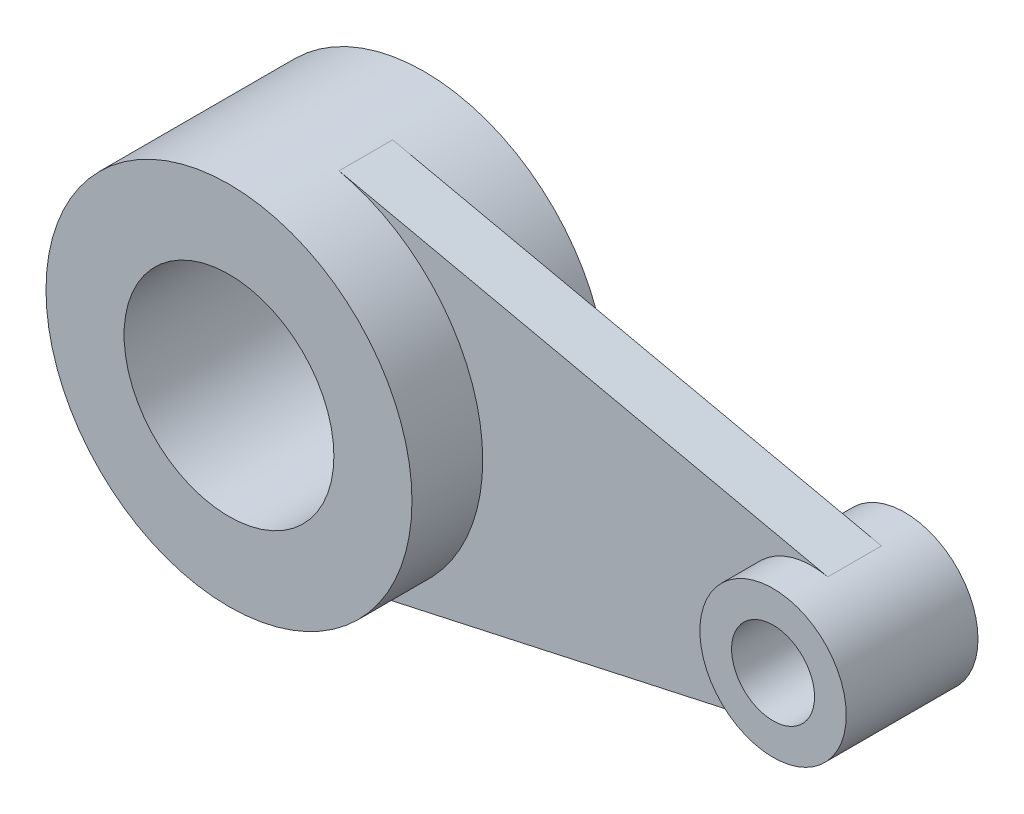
ISO-10303-21;
HEADER;
FILE_DESCRIPTION(('STEP AP214'),'2;1');
FILE_NAME('part.step','',(''),(''),'','','');
FILE_SCHEMA(('AUTOMOTIVE_DESIGN { 1 0 10303 214 1 1 1 1 }'));
ENDSEC;
DATA;
#1=APPLICATION_CONTEXT('core data for automotive mechanical design processes');
#2=APPLICATION_PROTOCOL_DEFINITION('international standard','automotive_design',2000,#1);
#3=PRODUCT_CONTEXT('',#1,'mechanical');
#4=PRODUCT('Part','Part','',(#3));
#5=PRODUCT_RELATED_PRODUCT_CATEGORY('part','',(#4));
#6=PRODUCT_DEFINITION_FORMATION('','',#4);
#7=PRODUCT_DEFINITION_CONTEXT('part definition',#1,'design');
#8=PRODUCT_DEFINITION('design','',#6,#7);
#9=PRODUCT_DEFINITION_SHAPE('','',#8);
#10=(LENGTH_UNIT() NAMED_UNIT(*) SI_UNIT(.MILLI.,.METRE.));
#11=(NAMED_UNIT(*) PLANE_ANGLE_UNIT() SI_UNIT($,.RADIAN.));
#12=(NAMED_UNIT(*) SI_UNIT($,.STERADIAN.) SOLID_ANGLE_UNIT());
#13=UNCERTAINTY_MEASURE_WITH_UNIT(LENGTH_MEASURE(1.E-05),#10,'distance_accuracy_value','');
#14=(GEOMETRIC_REPRESENTATION_CONTEXT(3) GLOBAL_UNCERTAINTY_ASSIGNED_CONTEXT((#13)) GLOBAL_UNIT_ASSIGNED_CONTEXT((#10,
#11,#12)) REPRESENTATION_CONTEXT('',''));
#15=CARTESIAN_POINT('',(0.,0.,0.));
#16=DIRECTION('',(0.,0.,1.));
#17=DIRECTION('',(1.,0.,0.));
#18=AXIS2_PLACEMENT_3D('',#15,#16,#17);
#19=CARTESIAN_POINT('',(0.,0.,20.));
#20=DIRECTION('',(0.,0.,-1.));
#21=DIRECTION('',(-1.,0.,0.));
#22=AXIS2_PLACEMENT_3D('',#19,#20,#21);
#23=CYLINDRICAL_SURFACE('',#22,21.5);
#24=CARTESIAN_POINT('',(0.,0.,20.));
#25=DIRECTION('',(0.,0.,1.));
#26=DIRECTION('',(1.,0.,0.));
#27=AXIS2_PLACEMENT_3D('',#24,#25,#26);
#28=CIRCLE('',#27,21.5);
#29=CARTESIAN_POINT('',(21.5,0.,20.));
#30=VERTEX_POINT('',#29);
#31=EDGE_CURVE('E43',#30,#30,#28,.T.);
#32=ORIENTED_EDGE('',*,*,#31,.T.);
#33=EDGE_LOOP('',(#32));
#34=FACE_BOUND('',#33,.T.);
#35=CARTESIAN_POINT('',(0.,0.,-20.));
#36=DIRECTION('',(0.,0.,1.));
#37=DIRECTION('',(1.,0.,0.));
#38=AXIS2_PLACEMENT_3D('',#35,#36,#37);
#39=CIRCLE('',#38,21.5);
#40=CARTESIAN_POINT('',(21.5,0.,-20.));
#41=VERTEX_POINT('',#40);
#42=EDGE_CURVE('E96',#41,#41,#39,.T.);
#43=ORIENTED_EDGE('',*,*,#42,.F.);
#44=EDGE_LOOP('',(#43));
#45=FACE_BOUND('',#44,.T.);
#46=ADVANCED_FACE('F35',(#34,#45),#23,.F.);
#47=CARTESIAN_POINT('',(0.,0.,20.));
#48=DIRECTION('',(0.,0.,-1.));
#49=DIRECTION('',(-1.,0.,0.));
#50=AXIS2_PLACEMENT_3D('',#47,#48,#49);
#51=CYLINDRICAL_SURFACE('',#50,37.5);
#52=DIRECTION('',(0.,0.,-1.));
#53=VECTOR('',#52,1.);
#54=CARTESIAN_POINT('',(8.03571428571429,-36.6289133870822,5.50000000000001));
#55=LINE('',#54,#53);
#56=CARTESIAN_POINT('',(8.03571428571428,-36.6289133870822,5.50000000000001));
#57=VERTEX_POINT('',#56);
#58=CARTESIAN_POINT('',(8.03571428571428,-36.6289133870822,-5.50000000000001));
#59=VERTEX_POINT('',#58);
#60=EDGE_CURVE('E56',#57,#59,#55,.T.);
#61=ORIENTED_EDGE('',*,*,#60,.F.);
#62=CARTESIAN_POINT('',(0.,0.,5.50000000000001));
#63=DIRECTION('',(0.,0.,1.));
#64=DIRECTION('',(1.,0.,0.));
#65=AXIS2_PLACEMENT_3D('',#62,#63,#64);
#66=CIRCLE('',#65,37.5);
#67=CARTESIAN_POINT('',(8.03571428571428,36.6289133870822,5.50000000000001));
#68=VERTEX_POINT('',#67);
#69=EDGE_CURVE('E51',#57,#68,#66,.T.);
#70=ORIENTED_EDGE('',*,*,#69,.T.);
#71=DIRECTION('',(0.,0.,-1.));
#72=VECTOR('',#71,1.);
#73=CARTESIAN_POINT('',(8.03571428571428,36.6289133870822,5.50000000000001));
#74=LINE('',#73,#72);
#75=CARTESIAN_POINT('',(8.03571428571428,36.6289133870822,-5.50000000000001));
#76=VERTEX_POINT('',#75);
#77=EDGE_CURVE('E97',#68,#76,#74,.T.);
#78=ORIENTED_EDGE('',*,*,#77,.T.);
#79=CARTESIAN_POINT('',(0.,0.,-5.50000000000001));
#80=DIRECTION('',(0.,0.,1.));
#81=DIRECTION('',(1.,0.,0.));
#82=AXIS2_PLACEMENT_3D('',#79,#80,#81);
#83=CIRCLE('',#82,37.5);
#84=EDGE_CURVE('E100',#59,#76,#83,.T.);
#85=ORIENTED_EDGE('',*,*,#84,.F.);
#86=EDGE_LOOP('',(#61,#70,#78,#85));
#87=FACE_BOUND('',#86,.T.);
#88=CARTESIAN_POINT('',(0.,0.,20.));
#89=DIRECTION('',(0.,0.,1.));
#90=DIRECTION('',(1.,0.,0.));
#91=AXIS2_PLACEMENT_3D('',#88,#89,#90);
#92=CIRCLE('',#91,37.5);
#93=CARTESIAN_POINT('',(37.5,0.,20.));
#94=VERTEX_POINT('',#93);
#95=EDGE_CURVE('E11',#94,#94,#92,.T.);
#96=ORIENTED_EDGE('',*,*,#95,.F.);
#97=EDGE_LOOP('',(#96));
#98=FACE_BOUND('',#97,.T.);
#99=CARTESIAN_POINT('',(0.,0.,-20.));
#100=DIRECTION('',(0.,0.,1.));
#101=DIRECTION('',(1.,0.,0.));
#102=AXIS2_PLACEMENT_3D('',#99,#100,#101);
#103=CIRCLE('',#102,37.5);
#104=CARTESIAN_POINT('',(37.5,0.,-20.));
#105=VERTEX_POINT('',#104);
#106=EDGE_CURVE('E38',#105,#105,#103,.T.);
#107=ORIENTED_EDGE('',*,*,#106,.T.);
#108=EDGE_LOOP('',(#107));
#109=FACE_BOUND('',#108,.T.);
#110=ADVANCED_FACE('F119',(#87,#98,#109),#51,.T.);
#111=CARTESIAN_POINT('',(39.814411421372,-134.546399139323,20.));
#112=DIRECTION('',(0.,0.,1.));
#113=DIRECTION('',(1.,0.,0.));
#114=AXIS2_PLACEMENT_3D('',#111,#112,#113);
#115=PLANE('',#114);
#116=ORIENTED_EDGE('',*,*,#31,.F.);
#117=EDGE_LOOP('',(#116));
#118=FACE_BOUND('',#117,.T.);
#119=ORIENTED_EDGE('',*,*,#95,.T.);
#120=EDGE_LOOP('',(#119));
#121=FACE_BOUND('',#120,.T.);
#122=ADVANCED_FACE('F123',(#118,#121),#115,.T.);
#123=CARTESIAN_POINT('',(39.814411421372,-134.546399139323,-20.));
#124=DIRECTION('',(0.,0.,1.));
#125=DIRECTION('',(1.,0.,0.));
#126=AXIS2_PLACEMENT_3D('',#123,#124,#125);
#127=PLANE('',#126);
#128=ORIENTED_EDGE('',*,*,#42,.T.);
#129=EDGE_LOOP('',(#128));
#130=FACE_BOUND('',#129,.T.);
#131=ORIENTED_EDGE('',*,*,#106,.F.);
#132=EDGE_LOOP('',(#131));
#133=FACE_BOUND('',#132,.T.);
#134=ADVANCED_FACE('F121',(#130,#133),#127,.F.);
#135=CARTESIAN_POINT('',(74.1835609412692,22.1172845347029,5.50000000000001));
#136=DIRECTION('',(-0.214285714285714,-0.976771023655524,0.));
#137=DIRECTION('',(0.976771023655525,-0.214285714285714,0.));
#138=AXIS2_PLACEMENT_3D('',#135,#136,#137);
#139=PLANE('',#138);
#140=DIRECTION('',(-0.976771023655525,0.214285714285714,0.));
#141=VECTOR('',#140,1.);
#142=CARTESIAN_POINT('',(74.1835609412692,22.1172845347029,-5.50000000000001));
#143=LINE('',#142,#141);
#144=CARTESIAN_POINT('',(108.214285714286,14.6515653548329,-5.50000000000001));
#145=VERTEX_POINT('',#144);
#146=EDGE_CURVE('E86',#145,#76,#143,.T.);
#147=ORIENTED_EDGE('',*,*,#146,.T.);
#148=ORIENTED_EDGE('',*,*,#77,.F.);
#149=DIRECTION('',(-0.976771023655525,0.214285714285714,0.));
#150=VECTOR('',#149,1.);
#151=CARTESIAN_POINT('',(74.1835609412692,22.1172845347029,5.50000000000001));
#152=LINE('',#151,#150);
#153=CARTESIAN_POINT('',(108.214285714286,14.6515653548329,5.50000000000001));
#154=VERTEX_POINT('',#153);
#155=EDGE_CURVE('E94',#154,#68,#152,.T.);
#156=ORIENTED_EDGE('',*,*,#155,.F.);
#157=DIRECTION('',(0.,0.,-1.));
#158=VECTOR('',#157,1.);
#159=CARTESIAN_POINT('',(108.214285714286,14.6515653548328,5.50000000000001));
#160=LINE('',#159,#158);
#161=EDGE_CURVE('E78',#154,#145,#160,.T.);
#162=ORIENTED_EDGE('',*,*,#161,.T.);
#163=EDGE_LOOP('',(#147,#148,#156,#162));
#164=FACE_BOUND('',#163,.T.);
#165=ADVANCED_FACE('F91',(#164),#139,.F.);
#166=CARTESIAN_POINT('',(17.860264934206,-34.4735864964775,5.50000000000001));
#167=DIRECTION('',(0.214285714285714,-0.976771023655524,0.));
#168=DIRECTION('',(0.976771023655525,0.214285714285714,0.));
#169=AXIS2_PLACEMENT_3D('',#166,#167,#168);
#170=PLANE('',#169);
#171=DIRECTION('',(-0.976771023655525,-0.214285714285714,0.));
#172=VECTOR('',#171,1.);
#173=CARTESIAN_POINT('',(17.860264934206,-34.4735864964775,-5.50000000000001));
#174=LINE('',#173,#172);
#175=CARTESIAN_POINT('',(108.214285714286,-14.6515653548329,-5.50000000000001));
#176=VERTEX_POINT('',#175);
#177=EDGE_CURVE('E102',#176,#59,#174,.T.);
#178=ORIENTED_EDGE('',*,*,#177,.F.);
#179=DIRECTION('',(0.,0.,-1.));
#180=VECTOR('',#179,1.);
#181=CARTESIAN_POINT('',(108.214285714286,-14.6515653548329,5.50000000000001));
#182=LINE('',#181,#180);
#183=CARTESIAN_POINT('',(108.214285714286,-14.6515653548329,5.50000000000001));
#184=VERTEX_POINT('',#183);
#185=EDGE_CURVE('E81',#184,#176,#182,.T.);
#186=ORIENTED_EDGE('',*,*,#185,.F.);
#187=DIRECTION('',(-0.976771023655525,-0.214285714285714,0.));
#188=VECTOR('',#187,1.);
#189=CARTESIAN_POINT('',(17.860264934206,-34.4735864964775,5.50000000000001));
#190=LINE('',#189,#188);
#191=EDGE_CURVE('E109',#184,#57,#190,.T.);
#192=ORIENTED_EDGE('',*,*,#191,.T.);
#193=ORIENTED_EDGE('',*,*,#60,.T.);
#194=EDGE_LOOP('',(#178,#186,#192,#193));
#195=FACE_BOUND('',#194,.T.);
#196=ADVANCED_FACE('F129',(#195),#170,.T.);
#197=CARTESIAN_POINT('',(39.814411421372,-134.546399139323,5.50000000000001));
#198=DIRECTION('',(0.,0.,1.));
#199=DIRECTION('',(1.,0.,0.));
#200=AXIS2_PLACEMENT_3D('',#197,#198,#199);
#201=PLANE('',#200);
#202=CARTESIAN_POINT('',(105.,0.,5.50000000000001));
#203=DIRECTION('',(0.,0.,1.));
#204=DIRECTION('',(1.,0.,0.));
#205=AXIS2_PLACEMENT_3D('',#202,#203,#204);
#206=CIRCLE('',#205,15.);
#207=EDGE_CURVE('E107',#154,#184,#206,.T.);
#208=ORIENTED_EDGE('',*,*,#207,.F.);
#209=ORIENTED_EDGE('',*,*,#155,.T.);
#210=ORIENTED_EDGE('',*,*,#69,.F.);
#211=ORIENTED_EDGE('',*,*,#191,.F.);
#212=EDGE_LOOP('',(#208,#209,#210,#211));
#213=FACE_BOUND('',#212,.T.);
#214=ADVANCED_FACE('F161',(#213),#201,.T.);
#215=CARTESIAN_POINT('',(39.814411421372,-134.546399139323,-5.50000000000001));
#216=DIRECTION('',(0.,0.,1.));
#217=DIRECTION('',(1.,0.,0.));
#218=AXIS2_PLACEMENT_3D('',#215,#216,#217);
#219=PLANE('',#218);
#220=CARTESIAN_POINT('',(105.,0.,-5.50000000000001));
#221=DIRECTION('',(0.,0.,1.));
#222=DIRECTION('',(1.,0.,0.));
#223=AXIS2_PLACEMENT_3D('',#220,#221,#222);
#224=CIRCLE('',#223,15.);
#225=EDGE_CURVE('E74',#145,#176,#224,.T.);
#226=ORIENTED_EDGE('',*,*,#225,.T.);
#227=ORIENTED_EDGE('',*,*,#177,.T.);
#228=ORIENTED_EDGE('',*,*,#84,.T.);
#229=ORIENTED_EDGE('',*,*,#146,.F.);
#230=EDGE_LOOP('',(#226,#227,#228,#229));
#231=FACE_BOUND('',#230,.T.);
#232=ADVANCED_FACE('F99',(#231),#219,.F.);
#233=CARTESIAN_POINT('',(105.,0.,13.5));
#234=DIRECTION('',(0.,0.,-1.));
#235=DIRECTION('',(-1.,0.,0.));
#236=AXIS2_PLACEMENT_3D('',#233,#234,#235);
#237=CYLINDRICAL_SURFACE('',#236,8.50000000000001);
#238=CARTESIAN_POINT('',(105.,0.,13.5));
#239=DIRECTION('',(0.,0.,1.));
#240=DIRECTION('',(1.,0.,0.));
#241=AXIS2_PLACEMENT_3D('',#238,#239,#240);
#242=CIRCLE('',#241,8.50000000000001);
#243=CARTESIAN_POINT('',(113.5,0.,13.5));
#244=VERTEX_POINT('',#243);
#245=EDGE_CURVE('E229',#244,#244,#242,.T.);
#246=ORIENTED_EDGE('',*,*,#245,.T.);
#247=EDGE_LOOP('',(#246));
#248=FACE_BOUND('',#247,.T.);
#249=CARTESIAN_POINT('',(105.,0.,-13.5));
#250=DIRECTION('',(0.,0.,1.));
#251=DIRECTION('',(1.,0.,0.));
#252=AXIS2_PLACEMENT_3D('',#249,#250,#251);
#253=CIRCLE('',#252,8.50000000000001);
#254=CARTESIAN_POINT('',(113.5,0.,-13.5));
#255=VERTEX_POINT('',#254);
#256=EDGE_CURVE('E224',#255,#255,#253,.T.);
#257=ORIENTED_EDGE('',*,*,#256,.F.);
#258=EDGE_LOOP('',(#257));
#259=FACE_BOUND('',#258,.T.);
#260=ADVANCED_FACE('F180',(#248,#259),#237,.F.);
#261=CARTESIAN_POINT('',(105.,0.,13.5));
#262=DIRECTION('',(0.,0.,-1.));
#263=DIRECTION('',(-1.,0.,0.));
#264=AXIS2_PLACEMENT_3D('',#261,#262,#263);
#265=CYLINDRICAL_SURFACE('',#264,15.);
#266=ORIENTED_EDGE('',*,*,#207,.T.);
#267=ORIENTED_EDGE('',*,*,#185,.T.);
#268=ORIENTED_EDGE('',*,*,#225,.F.);
#269=ORIENTED_EDGE('',*,*,#161,.F.);
#270=EDGE_LOOP('',(#266,#267,#268,#269));
#271=FACE_BOUND('',#270,.T.);
#272=CARTESIAN_POINT('',(105.,0.,13.5));
#273=DIRECTION('',(0.,0.,1.));
#274=DIRECTION('',(1.,0.,0.));
#275=AXIS2_PLACEMENT_3D('',#272,#273,#274);
#276=CIRCLE('',#275,15.);
#277=CARTESIAN_POINT('',(120.,0.,13.5));
#278=VERTEX_POINT('',#277);
#279=EDGE_CURVE('E87',#278,#278,#276,.T.);
#280=ORIENTED_EDGE('',*,*,#279,.F.);
#281=EDGE_LOOP('',(#280));
#282=FACE_BOUND('',#281,.T.);
#283=CARTESIAN_POINT('',(105.,0.,-13.5));
#284=DIRECTION('',(0.,0.,1.));
#285=DIRECTION('',(1.,0.,0.));
#286=AXIS2_PLACEMENT_3D('',#283,#284,#285);
#287=CIRCLE('',#286,15.);
#288=CARTESIAN_POINT('',(120.,0.,-13.5));
#289=VERTEX_POINT('',#288);
#290=EDGE_CURVE('E227',#289,#289,#287,.T.);
#291=ORIENTED_EDGE('',*,*,#290,.T.);
#292=EDGE_LOOP('',(#291));
#293=FACE_BOUND('',#292,.T.);
#294=ADVANCED_FACE('F76',(#271,#282,#293),#265,.T.);
#295=CARTESIAN_POINT('',(39.814411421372,-134.546399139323,13.5));
#296=DIRECTION('',(0.,0.,1.));
#297=DIRECTION('',(1.,0.,0.));
#298=AXIS2_PLACEMENT_3D('',#295,#296,#297);
#299=PLANE('',#298);
#300=ORIENTED_EDGE('',*,*,#245,.F.);
#301=EDGE_LOOP('',(#300));
#302=FACE_BOUND('',#301,.T.);
#303=ORIENTED_EDGE('',*,*,#279,.T.);
#304=EDGE_LOOP('',(#303));
#305=FACE_BOUND('',#304,.T.);
#306=ADVANCED_FACE('F198',(#302,#305),#299,.T.);
#307=CARTESIAN_POINT('',(39.814411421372,-134.546399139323,-13.5));
#308=DIRECTION('',(0.,0.,1.));
#309=DIRECTION('',(1.,0.,0.));
#310=AXIS2_PLACEMENT_3D('',#307,#308,#309);
#311=PLANE('',#310);
#312=ORIENTED_EDGE('',*,*,#256,.T.);
#313=EDGE_LOOP('',(#312));
#314=FACE_BOUND('',#313,.T.);
#315=ORIENTED_EDGE('',*,*,#290,.F.);
#316=EDGE_LOOP('',(#315));
#317=FACE_BOUND('',#316,.T.);
#318=ADVANCED_FACE('F207',(#314,#317),#311,.F.);
#319=CLOSED_SHELL('',(#46,#110,#122,#134,#165,#196,#214,#232,#260,#294,#306,#318));
#320=MANIFOLD_SOLID_BREP('B2',#319);
#321=ADVANCED_BREP_SHAPE_REPRESENTATION('',(#18,#320),#14);
#322=SHAPE_DEFINITION_REPRESENTATION(#9,#321);
ENDSEC;
END-ISO-10303-21;
